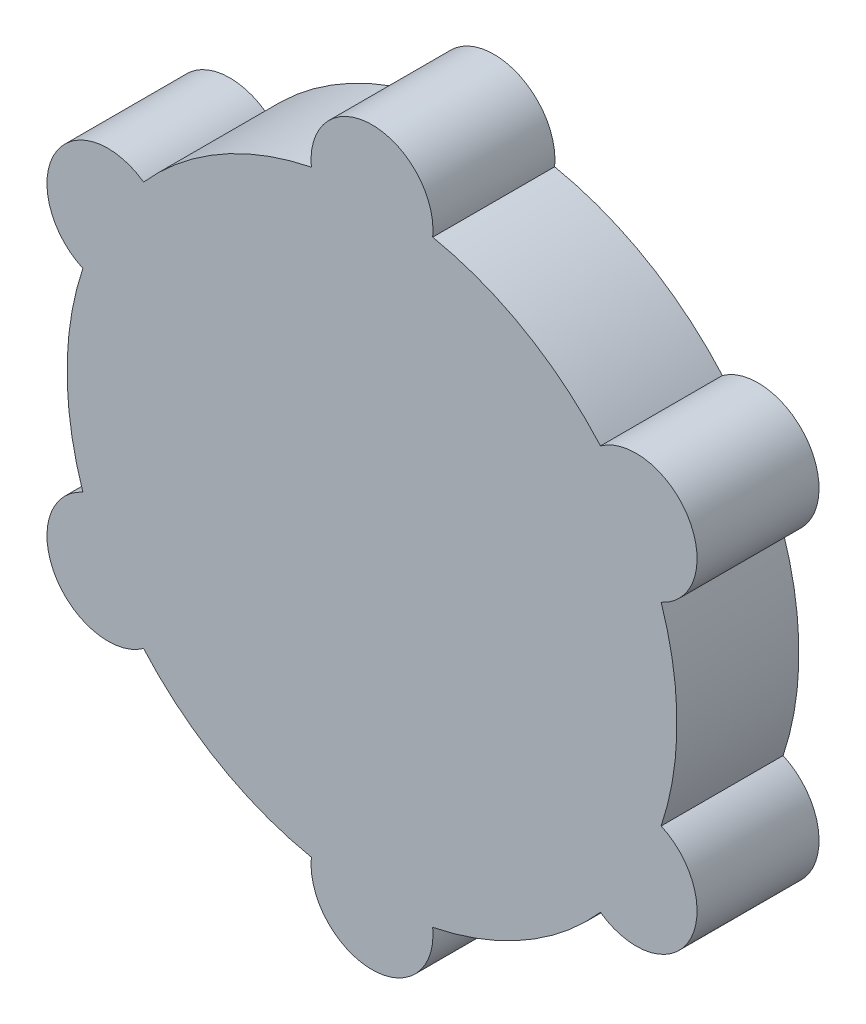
from build123d import *

# Parameters (mm, degrees)
BASE_EXTRUDE_DEPTH = 20


with BuildPart() as part:
    # Sketch1 → Base-Extrude (new body)
    with BuildSketch(Plane(origin=(0, 0, 0), x_dir=(0.8660254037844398, 0.49999999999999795, 0), z_dir=(0, 0, 1))):
        with BuildLine():
            ThreePointArc((49, 9.949874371), (43.301270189, 25), (33.11684397, 37.4603076))
            ThreePointArc((33.11684397, 37.4603076), (30, 51.961524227), (15.88315603, 47.410181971))
            ThreePointArc((15.88315603, 47.410181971), (0, 50), (-15.88315603, 47.410181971))
            ThreePointArc((-15.88315603, 47.410181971), (-30, 51.961524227), (-33.11684397, 37.4603076))
            ThreePointArc((-33.11684397, 37.4603076), (-43.301270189, 25), (-49, 9.949874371))
            ThreePointArc((-49, 9.949874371), (-60, 0), (-49, -9.949874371))
            ThreePointArc((-49, -9.949874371), (-43.301270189, -25), (-33.11684397, -37.4603076))
            ThreePointArc((-33.11684397, -37.4603076), (-30, -51.961524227), (-15.88315603, -47.410181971))
            ThreePointArc((-15.88315603, -47.410181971), (0, -50), (15.88315603, -47.410181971))
            ThreePointArc((15.88315603, -47.410181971), (30, -51.961524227), (33.11684397, -37.4603076))
            ThreePointArc((33.11684397, -37.4603076), (43.301270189, -25), (49, -9.949874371))
            ThreePointArc((49, -9.949874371), (60, 0), (49, 9.949874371))
        make_face()
    extrude(amount=BASE_EXTRUDE_DEPTH)


solid = part.part
